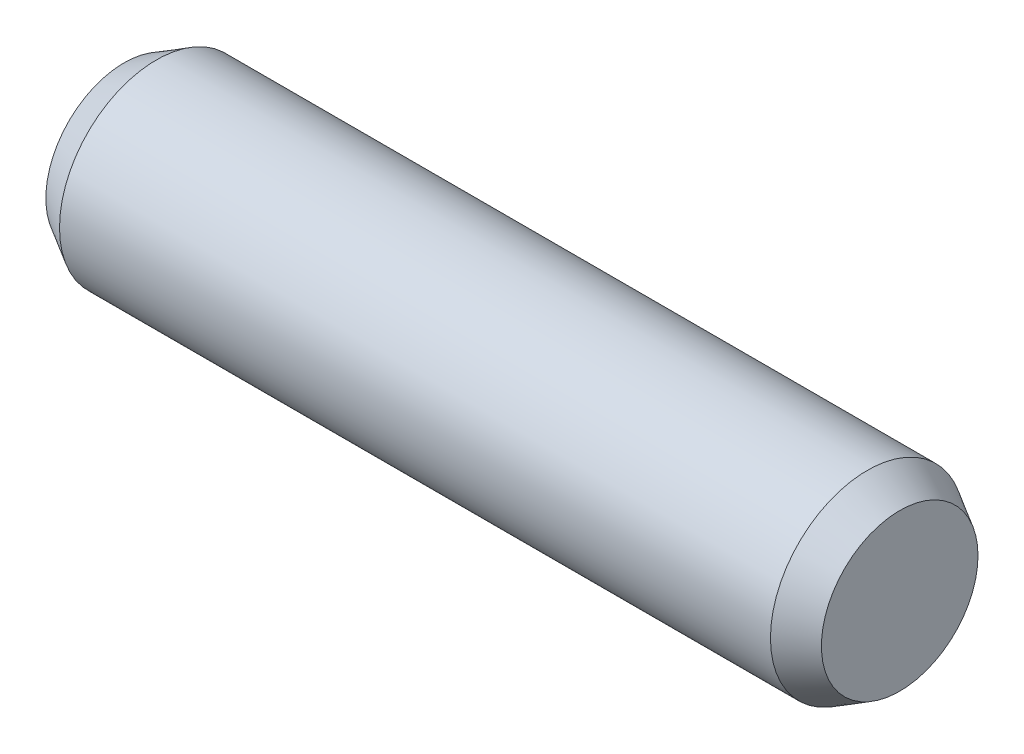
ISO-10303-21;
HEADER;
FILE_DESCRIPTION(('STEP AP214'),'2;1');
FILE_NAME('part.step','',(''),(''),'','','');
FILE_SCHEMA(('AUTOMOTIVE_DESIGN { 1 0 10303 214 1 1 1 1 }'));
ENDSEC;
DATA;
#1=APPLICATION_CONTEXT('core data for automotive mechanical design processes');
#2=APPLICATION_PROTOCOL_DEFINITION('international standard','automotive_design',2000,#1);
#3=PRODUCT_CONTEXT('',#1,'mechanical');
#4=PRODUCT('Part','Part','',(#3));
#5=PRODUCT_RELATED_PRODUCT_CATEGORY('part','',(#4));
#6=PRODUCT_DEFINITION_FORMATION('','',#4);
#7=PRODUCT_DEFINITION_CONTEXT('part definition',#1,'design');
#8=PRODUCT_DEFINITION('design','',#6,#7);
#9=PRODUCT_DEFINITION_SHAPE('','',#8);
#10=(LENGTH_UNIT() NAMED_UNIT(*) SI_UNIT(.MILLI.,.METRE.));
#11=(NAMED_UNIT(*) PLANE_ANGLE_UNIT() SI_UNIT($,.RADIAN.));
#12=(NAMED_UNIT(*) SI_UNIT($,.STERADIAN.) SOLID_ANGLE_UNIT());
#13=UNCERTAINTY_MEASURE_WITH_UNIT(LENGTH_MEASURE(1.E-05),#10,'distance_accuracy_value','');
#14=(GEOMETRIC_REPRESENTATION_CONTEXT(3) GLOBAL_UNCERTAINTY_ASSIGNED_CONTEXT((#13)) GLOBAL_UNIT_ASSIGNED_CONTEXT((#10,
#11,#12)) REPRESENTATION_CONTEXT('',''));
#15=CARTESIAN_POINT('',(0.,0.,0.));
#16=DIRECTION('',(0.,0.,1.));
#17=DIRECTION('',(1.,0.,0.));
#18=AXIS2_PLACEMENT_3D('',#15,#16,#17);
#19=CARTESIAN_POINT('',(6.,0.,0.));
#20=DIRECTION('',(-1.,0.,0.));
#21=DIRECTION('',(0.,0.,1.));
#22=AXIS2_PLACEMENT_3D('',#19,#20,#21);
#23=CYLINDRICAL_SURFACE('',#22,1.5);
#24=CARTESIAN_POINT('',(5.5,0.,0.));
#25=DIRECTION('',(1.,0.,0.));
#26=DIRECTION('',(0.,0.,-1.));
#27=AXIS2_PLACEMENT_3D('',#24,#25,#26);
#28=CIRCLE('',#27,1.5);
#29=CARTESIAN_POINT('',(5.5,0.,-1.5));
#30=VERTEX_POINT('',#29);
#31=EDGE_CURVE('E40',#30,#30,#28,.F.);
#32=ORIENTED_EDGE('',*,*,#31,.T.);
#33=EDGE_LOOP('',(#32));
#34=FACE_BOUND('',#33,.T.);
#35=CARTESIAN_POINT('',(-5.5,0.,0.));
#36=DIRECTION('',(1.,0.,0.));
#37=DIRECTION('',(0.,0.,-1.));
#38=AXIS2_PLACEMENT_3D('',#35,#36,#37);
#39=CIRCLE('',#38,1.5);
#40=CARTESIAN_POINT('',(-5.5,0.,-1.5));
#41=VERTEX_POINT('',#40);
#42=EDGE_CURVE('E44',#41,#41,#39,.T.);
#43=ORIENTED_EDGE('',*,*,#42,.T.);
#44=EDGE_LOOP('',(#43));
#45=FACE_BOUND('',#44,.T.);
#46=ADVANCED_FACE('F33',(#34,#45),#23,.T.);
#47=CARTESIAN_POINT('',(6.,0.,0.));
#48=DIRECTION('',(1.,0.,0.));
#49=DIRECTION('',(0.,0.,-1.));
#50=AXIS2_PLACEMENT_3D('',#47,#48,#49);
#51=PLANE('',#50);
#52=CARTESIAN_POINT('',(6.,0.,0.));
#53=DIRECTION('',(1.,0.,0.));
#54=DIRECTION('',(0.,0.,-1.));
#55=AXIS2_PLACEMENT_3D('',#52,#53,#54);
#56=CIRCLE('',#55,1.21132486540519);
#57=CARTESIAN_POINT('',(6.,0.,-1.21132486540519));
#58=VERTEX_POINT('',#57);
#59=EDGE_CURVE('E48',#58,#58,#56,.T.);
#60=ORIENTED_EDGE('',*,*,#59,.T.);
#61=EDGE_LOOP('',(#60));
#62=FACE_BOUND('',#61,.T.);
#63=ADVANCED_FACE('F54',(#62),#51,.T.);
#64=CARTESIAN_POINT('',(-6.,0.,0.));
#65=DIRECTION('',(1.,0.,0.));
#66=DIRECTION('',(0.,0.,-1.));
#67=AXIS2_PLACEMENT_3D('',#64,#65,#66);
#68=PLANE('',#67);
#69=CARTESIAN_POINT('',(-6.,0.,0.));
#70=DIRECTION('',(1.,0.,0.));
#71=DIRECTION('',(0.,0.,-1.));
#72=AXIS2_PLACEMENT_3D('',#69,#70,#71);
#73=CIRCLE('',#72,1.21132486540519);
#74=CARTESIAN_POINT('',(-6.,0.,-1.21132486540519));
#75=VERTEX_POINT('',#74);
#76=EDGE_CURVE('E10',#75,#75,#73,.F.);
#77=ORIENTED_EDGE('',*,*,#76,.T.);
#78=EDGE_LOOP('',(#77));
#79=FACE_BOUND('',#78,.T.);
#80=ADVANCED_FACE('F58',(#79),#68,.F.);
#81=CARTESIAN_POINT('',(6.,0.,0.));
#82=DIRECTION('',(-1.,0.,0.));
#83=DIRECTION('',(0.,0.,1.));
#84=AXIS2_PLACEMENT_3D('',#81,#82,#83);
#85=CONICAL_SURFACE('',#84,1.21132486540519,0.523598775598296);
#86=ORIENTED_EDGE('',*,*,#31,.F.);
#87=EDGE_LOOP('',(#86));
#88=FACE_BOUND('',#87,.T.);
#89=ORIENTED_EDGE('',*,*,#59,.F.);
#90=EDGE_LOOP('',(#89));
#91=FACE_BOUND('',#90,.T.);
#92=ADVANCED_FACE('F56',(#88,#91),#85,.T.);
#93=CARTESIAN_POINT('',(-5.5,0.,0.));
#94=DIRECTION('',(1.,0.,0.));
#95=DIRECTION('',(0.,0.,-1.));
#96=AXIS2_PLACEMENT_3D('',#93,#94,#95);
#97=CONICAL_SURFACE('',#96,1.5,0.523598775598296);
#98=ORIENTED_EDGE('',*,*,#76,.F.);
#99=EDGE_LOOP('',(#98));
#100=FACE_BOUND('',#99,.T.);
#101=ORIENTED_EDGE('',*,*,#42,.F.);
#102=EDGE_LOOP('',(#101));
#103=FACE_BOUND('',#102,.T.);
#104=ADVANCED_FACE('F35',(#100,#103),#97,.T.);
#105=CLOSED_SHELL('',(#46,#63,#80,#92,#104));
#106=MANIFOLD_SOLID_BREP('B2',#105);
#107=ADVANCED_BREP_SHAPE_REPRESENTATION('',(#18,#106),#14);
#108=SHAPE_DEFINITION_REPRESENTATION(#9,#107);
ENDSEC;
END-ISO-10303-21;
